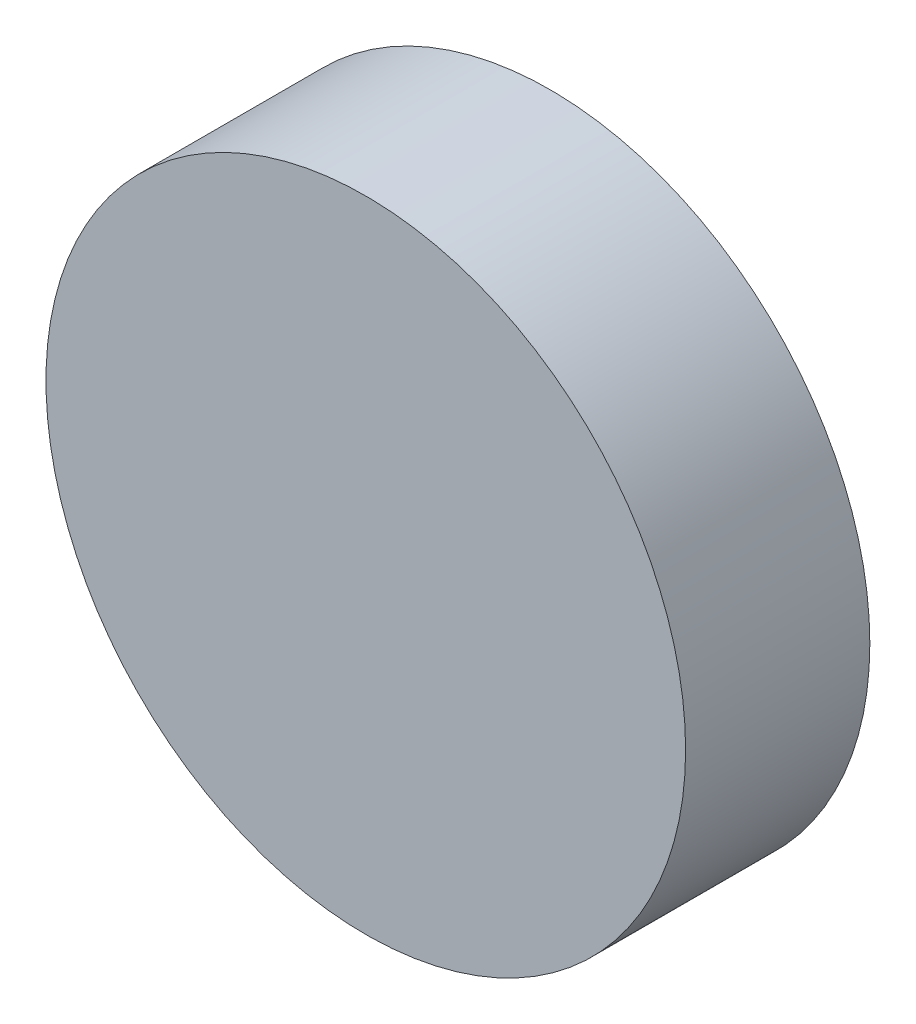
ISO-10303-21;
HEADER;
FILE_DESCRIPTION(('STEP AP214'),'2;1');
FILE_NAME('part.step','',(''),(''),'','','');
FILE_SCHEMA(('AUTOMOTIVE_DESIGN { 1 0 10303 214 1 1 1 1 }'));
ENDSEC;
DATA;
#1=APPLICATION_CONTEXT('core data for automotive mechanical design processes');
#2=APPLICATION_PROTOCOL_DEFINITION('international standard','automotive_design',2000,#1);
#3=PRODUCT_CONTEXT('',#1,'mechanical');
#4=PRODUCT('Part','Part','',(#3));
#5=PRODUCT_RELATED_PRODUCT_CATEGORY('part','',(#4));
#6=PRODUCT_DEFINITION_FORMATION('','',#4);
#7=PRODUCT_DEFINITION_CONTEXT('part definition',#1,'design');
#8=PRODUCT_DEFINITION('design','',#6,#7);
#9=PRODUCT_DEFINITION_SHAPE('','',#8);
#10=(LENGTH_UNIT() NAMED_UNIT(*) SI_UNIT(.MILLI.,.METRE.));
#11=(NAMED_UNIT(*) PLANE_ANGLE_UNIT() SI_UNIT($,.RADIAN.));
#12=(NAMED_UNIT(*) SI_UNIT($,.STERADIAN.) SOLID_ANGLE_UNIT());
#13=UNCERTAINTY_MEASURE_WITH_UNIT(LENGTH_MEASURE(1.E-05),#10,'distance_accuracy_value','');
#14=(GEOMETRIC_REPRESENTATION_CONTEXT(3) GLOBAL_UNCERTAINTY_ASSIGNED_CONTEXT((#13)) GLOBAL_UNIT_ASSIGNED_CONTEXT((#10,
#11,#12)) REPRESENTATION_CONTEXT('',''));
#15=CARTESIAN_POINT('',(0.,0.,0.));
#16=DIRECTION('',(0.,0.,1.));
#17=DIRECTION('',(1.,0.,0.));
#18=AXIS2_PLACEMENT_3D('',#15,#16,#17);
#19=CARTESIAN_POINT('',(0.,0.,10.));
#20=DIRECTION('',(0.,0.,-1.));
#21=DIRECTION('',(-1.,0.,0.));
#22=AXIS2_PLACEMENT_3D('',#19,#20,#21);
#23=CYLINDRICAL_SURFACE('',#22,17.3604912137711);
#24=CARTESIAN_POINT('',(0.,0.,10.));
#25=DIRECTION('',(0.,0.,1.));
#26=DIRECTION('',(1.,0.,0.));
#27=AXIS2_PLACEMENT_3D('',#24,#25,#26);
#28=CIRCLE('',#27,17.3604912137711);
#29=CARTESIAN_POINT('',(17.3604912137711,0.,10.));
#30=VERTEX_POINT('',#29);
#31=EDGE_CURVE('E10',#30,#30,#28,.T.);
#32=ORIENTED_EDGE('',*,*,#31,.F.);
#33=EDGE_LOOP('',(#32));
#34=FACE_BOUND('',#33,.T.);
#35=CARTESIAN_POINT('',(0.,0.,0.));
#36=DIRECTION('',(0.,0.,1.));
#37=DIRECTION('',(1.,0.,0.));
#38=AXIS2_PLACEMENT_3D('',#35,#36,#37);
#39=CIRCLE('',#38,17.3604912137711);
#40=CARTESIAN_POINT('',(17.3604912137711,0.,0.));
#41=VERTEX_POINT('',#40);
#42=EDGE_CURVE('E37',#41,#41,#39,.T.);
#43=ORIENTED_EDGE('',*,*,#42,.T.);
#44=EDGE_LOOP('',(#43));
#45=FACE_BOUND('',#44,.T.);
#46=ADVANCED_FACE('F40',(#34,#45),#23,.T.);
#47=CARTESIAN_POINT('',(0.,0.,10.));
#48=DIRECTION('',(0.,0.,1.));
#49=DIRECTION('',(1.,0.,0.));
#50=AXIS2_PLACEMENT_3D('',#47,#48,#49);
#51=PLANE('',#50);
#52=ORIENTED_EDGE('',*,*,#31,.T.);
#53=EDGE_LOOP('',(#52));
#54=FACE_BOUND('',#53,.T.);
#55=ADVANCED_FACE('F55',(#54),#51,.T.);
#56=CARTESIAN_POINT('',(0.,0.,0.));
#57=DIRECTION('',(0.,0.,1.));
#58=DIRECTION('',(1.,0.,0.));
#59=AXIS2_PLACEMENT_3D('',#56,#57,#58);
#60=PLANE('',#59);
#61=ORIENTED_EDGE('',*,*,#42,.F.);
#62=EDGE_LOOP('',(#61));
#63=FACE_BOUND('',#62,.T.);
#64=ADVANCED_FACE('F49',(#63),#60,.F.);
#65=CLOSED_SHELL('',(#46,#55,#64));
#66=MANIFOLD_SOLID_BREP('B2',#65);
#67=ADVANCED_BREP_SHAPE_REPRESENTATION('',(#18,#66),#14);
#68=SHAPE_DEFINITION_REPRESENTATION(#9,#67);
ENDSEC;
END-ISO-10303-21;
